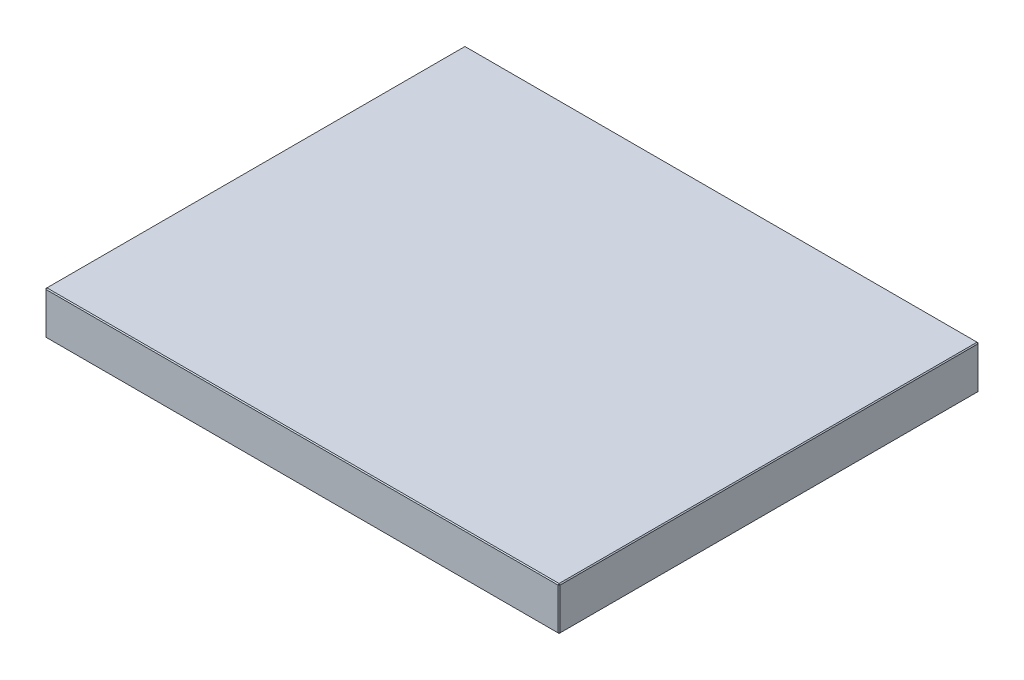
ISO-10303-21;
HEADER;
FILE_DESCRIPTION(('STEP AP214'),'2;1');
FILE_NAME('part.step','',(''),(''),'','','');
FILE_SCHEMA(('AUTOMOTIVE_DESIGN { 1 0 10303 214 1 1 1 1 }'));
ENDSEC;
DATA;
#1=APPLICATION_CONTEXT('core data for automotive mechanical design processes');
#2=APPLICATION_PROTOCOL_DEFINITION('international standard','automotive_design',2000,#1);
#3=PRODUCT_CONTEXT('',#1,'mechanical');
#4=PRODUCT('Part','Part','',(#3));
#5=PRODUCT_RELATED_PRODUCT_CATEGORY('part','',(#4));
#6=PRODUCT_DEFINITION_FORMATION('','',#4);
#7=PRODUCT_DEFINITION_CONTEXT('part definition',#1,'design');
#8=PRODUCT_DEFINITION('design','',#6,#7);
#9=PRODUCT_DEFINITION_SHAPE('','',#8);
#10=(LENGTH_UNIT() NAMED_UNIT(*) SI_UNIT(.MILLI.,.METRE.));
#11=(NAMED_UNIT(*) PLANE_ANGLE_UNIT() SI_UNIT($,.RADIAN.));
#12=(NAMED_UNIT(*) SI_UNIT($,.STERADIAN.) SOLID_ANGLE_UNIT());
#13=UNCERTAINTY_MEASURE_WITH_UNIT(LENGTH_MEASURE(1.E-05),#10,'distance_accuracy_value','');
#14=(GEOMETRIC_REPRESENTATION_CONTEXT(3) GLOBAL_UNCERTAINTY_ASSIGNED_CONTEXT((#13)) GLOBAL_UNIT_ASSIGNED_CONTEXT((#10,
#11,#12)) REPRESENTATION_CONTEXT('',''));
#15=CARTESIAN_POINT('',(0.,0.,0.));
#16=DIRECTION('',(0.,0.,1.));
#17=DIRECTION('',(1.,0.,0.));
#18=AXIS2_PLACEMENT_3D('',#15,#16,#17);
#19=CARTESIAN_POINT('',(-273.,46.,223.));
#20=DIRECTION('',(1.,0.,0.));
#21=DIRECTION('',(0.,0.,-1.));
#22=AXIS2_PLACEMENT_3D('',#19,#20,#21);
#23=PLANE('',#22);
#24=DIRECTION('',(0.,-1.,0.));
#25=VECTOR('',#24,1.);
#26=CARTESIAN_POINT('',(-273.,46.,-222.));
#27=LINE('',#26,#25);
#28=CARTESIAN_POINT('',(-273.,45.,-222.));
#29=VERTEX_POINT('',#28);
#30=CARTESIAN_POINT('',(-273.,1.,-222.));
#31=VERTEX_POINT('',#30);
#32=EDGE_CURVE('E115',#29,#31,#27,.T.);
#33=ORIENTED_EDGE('',*,*,#32,.T.);
#34=DIRECTION('',(0.,0.,1.));
#35=VECTOR('',#34,1.);
#36=CARTESIAN_POINT('',(-273.,1.,223.));
#37=LINE('',#36,#35);
#38=CARTESIAN_POINT('',(-273.,1.,222.));
#39=VERTEX_POINT('',#38);
#40=EDGE_CURVE('E111',#31,#39,#37,.T.);
#41=ORIENTED_EDGE('',*,*,#40,.T.);
#42=DIRECTION('',(0.,1.,0.));
#43=VECTOR('',#42,1.);
#44=CARTESIAN_POINT('',(-273.,46.,222.));
#45=LINE('',#44,#43);
#46=CARTESIAN_POINT('',(-273.,45.,222.));
#47=VERTEX_POINT('',#46);
#48=EDGE_CURVE('E104',#39,#47,#45,.T.);
#49=ORIENTED_EDGE('',*,*,#48,.T.);
#50=DIRECTION('',(0.,0.,-1.));
#51=VECTOR('',#50,1.);
#52=CARTESIAN_POINT('',(-273.,45.,-223.));
#53=LINE('',#52,#51);
#54=EDGE_CURVE('E108',#47,#29,#53,.T.);
#55=ORIENTED_EDGE('',*,*,#54,.T.);
#56=EDGE_LOOP('',(#33,#41,#49,#55));
#57=FACE_BOUND('',#56,.T.);
#58=ADVANCED_FACE('F16',(#57),#23,.F.);
#59=CARTESIAN_POINT('',(273.,46.,223.));
#60=DIRECTION('',(0.,0.,-1.));
#61=DIRECTION('',(-1.,0.,0.));
#62=AXIS2_PLACEMENT_3D('',#59,#60,#61);
#63=PLANE('',#62);
#64=DIRECTION('',(-1.,0.,0.));
#65=VECTOR('',#64,1.);
#66=CARTESIAN_POINT('',(-273.,45.,223.));
#67=LINE('',#66,#65);
#68=CARTESIAN_POINT('',(272.,45.,223.));
#69=VERTEX_POINT('',#68);
#70=CARTESIAN_POINT('',(-272.,45.,223.));
#71=VERTEX_POINT('',#70);
#72=EDGE_CURVE('E165',#69,#71,#67,.T.);
#73=ORIENTED_EDGE('',*,*,#72,.T.);
#74=DIRECTION('',(0.,-1.,0.));
#75=VECTOR('',#74,1.);
#76=CARTESIAN_POINT('',(-272.,46.,223.));
#77=LINE('',#76,#75);
#78=CARTESIAN_POINT('',(-272.,0.999999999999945,223.));
#79=VERTEX_POINT('',#78);
#80=EDGE_CURVE('E123',#71,#79,#77,.T.);
#81=ORIENTED_EDGE('',*,*,#80,.T.);
#82=DIRECTION('',(1.,0.,0.));
#83=VECTOR('',#82,1.);
#84=CARTESIAN_POINT('',(273.,0.999999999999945,223.));
#85=LINE('',#84,#83);
#86=CARTESIAN_POINT('',(272.,0.999999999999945,223.));
#87=VERTEX_POINT('',#86);
#88=EDGE_CURVE('E169',#79,#87,#85,.T.);
#89=ORIENTED_EDGE('',*,*,#88,.T.);
#90=DIRECTION('',(0.,1.,0.));
#91=VECTOR('',#90,1.);
#92=CARTESIAN_POINT('',(272.,46.,223.));
#93=LINE('',#92,#91);
#94=EDGE_CURVE('E167',#87,#69,#93,.T.);
#95=ORIENTED_EDGE('',*,*,#94,.T.);
#96=EDGE_LOOP('',(#73,#81,#89,#95));
#97=FACE_BOUND('',#96,.T.);
#98=ADVANCED_FACE('F276',(#97),#63,.F.);
#99=CARTESIAN_POINT('',(273.,46.,223.));
#100=DIRECTION('',(-1.,0.,0.));
#101=DIRECTION('',(0.,0.,1.));
#102=AXIS2_PLACEMENT_3D('',#99,#100,#101);
#103=PLANE('',#102);
#104=DIRECTION('',(0.,0.,-1.));
#105=VECTOR('',#104,1.);
#106=CARTESIAN_POINT('',(273.,0.999999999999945,223.));
#107=LINE('',#106,#105);
#108=CARTESIAN_POINT('',(273.,0.999999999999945,222.));
#109=VERTEX_POINT('',#108);
#110=CARTESIAN_POINT('',(273.,0.999999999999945,-222.));
#111=VERTEX_POINT('',#110);
#112=EDGE_CURVE('E160',#109,#111,#107,.T.);
#113=ORIENTED_EDGE('',*,*,#112,.T.);
#114=DIRECTION('',(0.,1.,0.));
#115=VECTOR('',#114,1.);
#116=CARTESIAN_POINT('',(273.,46.,-222.));
#117=LINE('',#116,#115);
#118=CARTESIAN_POINT('',(273.,45.,-222.));
#119=VERTEX_POINT('',#118);
#120=EDGE_CURVE('E162',#111,#119,#117,.T.);
#121=ORIENTED_EDGE('',*,*,#120,.T.);
#122=DIRECTION('',(0.,0.,1.));
#123=VECTOR('',#122,1.);
#124=CARTESIAN_POINT('',(273.,45.,223.));
#125=LINE('',#124,#123);
#126=CARTESIAN_POINT('',(273.,45.,222.));
#127=VERTEX_POINT('',#126);
#128=EDGE_CURVE('E156',#119,#127,#125,.T.);
#129=ORIENTED_EDGE('',*,*,#128,.T.);
#130=DIRECTION('',(0.,-1.,0.));
#131=VECTOR('',#130,1.);
#132=CARTESIAN_POINT('',(273.,46.,222.));
#133=LINE('',#132,#131);
#134=EDGE_CURVE('E158',#127,#109,#133,.T.);
#135=ORIENTED_EDGE('',*,*,#134,.T.);
#136=EDGE_LOOP('',(#113,#121,#129,#135));
#137=FACE_BOUND('',#136,.T.);
#138=ADVANCED_FACE('F255',(#137),#103,.F.);
#139=CARTESIAN_POINT('',(273.,46.,-223.));
#140=DIRECTION('',(0.,0.,1.));
#141=DIRECTION('',(1.,0.,0.));
#142=AXIS2_PLACEMENT_3D('',#139,#140,#141);
#143=PLANE('',#142);
#144=DIRECTION('',(0.,-1.,0.));
#145=VECTOR('',#144,1.);
#146=CARTESIAN_POINT('',(272.,46.,-223.));
#147=LINE('',#146,#145);
#148=CARTESIAN_POINT('',(272.,45.,-223.));
#149=VERTEX_POINT('',#148);
#150=CARTESIAN_POINT('',(272.,0.999999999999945,-223.));
#151=VERTEX_POINT('',#150);
#152=EDGE_CURVE('E149',#149,#151,#147,.T.);
#153=ORIENTED_EDGE('',*,*,#152,.T.);
#154=DIRECTION('',(-1.,0.,0.));
#155=VECTOR('',#154,1.);
#156=CARTESIAN_POINT('',(273.,0.999999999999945,-223.));
#157=LINE('',#156,#155);
#158=CARTESIAN_POINT('',(-272.,0.999999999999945,-223.));
#159=VERTEX_POINT('',#158);
#160=EDGE_CURVE('E154',#151,#159,#157,.T.);
#161=ORIENTED_EDGE('',*,*,#160,.T.);
#162=DIRECTION('',(0.,1.,0.));
#163=VECTOR('',#162,1.);
#164=CARTESIAN_POINT('',(-272.,46.,-223.));
#165=LINE('',#164,#163);
#166=CARTESIAN_POINT('',(-272.,45.,-223.));
#167=VERTEX_POINT('',#166);
#168=EDGE_CURVE('E151',#159,#167,#165,.T.);
#169=ORIENTED_EDGE('',*,*,#168,.T.);
#170=DIRECTION('',(1.,0.,0.));
#171=VECTOR('',#170,1.);
#172=CARTESIAN_POINT('',(273.,45.,-223.));
#173=LINE('',#172,#171);
#174=EDGE_CURVE('E147',#167,#149,#173,.T.);
#175=ORIENTED_EDGE('',*,*,#174,.T.);
#176=EDGE_LOOP('',(#153,#161,#169,#175));
#177=FACE_BOUND('',#176,.T.);
#178=ADVANCED_FACE('F285',(#177),#143,.F.);
#179=CARTESIAN_POINT('',(0.,46.,0.));
#180=DIRECTION('',(0.,1.,0.));
#181=DIRECTION('',(0.,0.,1.));
#182=AXIS2_PLACEMENT_3D('',#179,#180,#181);
#183=PLANE('',#182);
#184=DIRECTION('',(0.,0.,-1.));
#185=VECTOR('',#184,1.);
#186=CARTESIAN_POINT('',(272.,46.,-223.));
#187=LINE('',#186,#185);
#188=CARTESIAN_POINT('',(272.,46.,222.));
#189=VERTEX_POINT('',#188);
#190=CARTESIAN_POINT('',(272.,46.,-222.));
#191=VERTEX_POINT('',#190);
#192=EDGE_CURVE('E25',#189,#191,#187,.T.);
#193=ORIENTED_EDGE('',*,*,#192,.T.);
#194=DIRECTION('',(-1.,0.,0.));
#195=VECTOR('',#194,1.);
#196=CARTESIAN_POINT('',(-273.,46.,-222.));
#197=LINE('',#196,#195);
#198=CARTESIAN_POINT('',(-272.,46.,-222.));
#199=VERTEX_POINT('',#198);
#200=EDGE_CURVE('E10',#191,#199,#197,.T.);
#201=ORIENTED_EDGE('',*,*,#200,.T.);
#202=DIRECTION('',(0.,0.,1.));
#203=VECTOR('',#202,1.);
#204=CARTESIAN_POINT('',(-272.,46.,223.));
#205=LINE('',#204,#203);
#206=CARTESIAN_POINT('',(-272.,46.,222.));
#207=VERTEX_POINT('',#206);
#208=EDGE_CURVE('E181',#199,#207,#205,.T.);
#209=ORIENTED_EDGE('',*,*,#208,.T.);
#210=DIRECTION('',(1.,0.,0.));
#211=VECTOR('',#210,1.);
#212=CARTESIAN_POINT('',(273.,46.,222.));
#213=LINE('',#212,#211);
#214=EDGE_CURVE('E36',#207,#189,#213,.T.);
#215=ORIENTED_EDGE('',*,*,#214,.T.);
#216=EDGE_LOOP('',(#193,#201,#209,#215));
#217=FACE_BOUND('',#216,.T.);
#218=ADVANCED_FACE('F351',(#217),#183,.T.);
#219=CARTESIAN_POINT('',(0.,0.,0.));
#220=DIRECTION('',(0.,1.,0.));
#221=DIRECTION('',(0.,0.,1.));
#222=AXIS2_PLACEMENT_3D('',#219,#220,#221);
#223=PLANE('',#222);
#224=DIRECTION('',(0.,0.,1.));
#225=VECTOR('',#224,1.);
#226=CARTESIAN_POINT('',(272.,0.,0.));
#227=LINE('',#226,#225);
#228=CARTESIAN_POINT('',(272.,0.,-222.));
#229=VERTEX_POINT('',#228);
#230=CARTESIAN_POINT('',(272.,0.,222.));
#231=VERTEX_POINT('',#230);
#232=EDGE_CURVE('E172',#229,#231,#227,.T.);
#233=ORIENTED_EDGE('',*,*,#232,.T.);
#234=DIRECTION('',(-1.,0.,0.));
#235=VECTOR('',#234,1.);
#236=CARTESIAN_POINT('',(0.,0.,222.));
#237=LINE('',#236,#235);
#238=CARTESIAN_POINT('',(-272.,0.,222.));
#239=VERTEX_POINT('',#238);
#240=EDGE_CURVE('E178',#231,#239,#237,.T.);
#241=ORIENTED_EDGE('',*,*,#240,.T.);
#242=DIRECTION('',(0.,0.,-1.));
#243=VECTOR('',#242,1.);
#244=CARTESIAN_POINT('',(-272.,0.,0.));
#245=LINE('',#244,#243);
#246=CARTESIAN_POINT('',(-272.,0.,-222.));
#247=VERTEX_POINT('',#246);
#248=EDGE_CURVE('E176',#239,#247,#245,.T.);
#249=ORIENTED_EDGE('',*,*,#248,.T.);
#250=DIRECTION('',(1.,0.,0.));
#251=VECTOR('',#250,1.);
#252=CARTESIAN_POINT('',(0.,0.,-222.));
#253=LINE('',#252,#251);
#254=EDGE_CURVE('E174',#247,#229,#253,.T.);
#255=ORIENTED_EDGE('',*,*,#254,.T.);
#256=EDGE_LOOP('',(#233,#241,#249,#255));
#257=FACE_BOUND('',#256,.T.);
#258=ADVANCED_FACE('F247',(#257),#223,.F.);
#259=CARTESIAN_POINT('',(273.,46.,222.));
#260=DIRECTION('',(-0.707106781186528,0.,-0.707106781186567));
#261=DIRECTION('',(0.,-1.,0.));
#262=AXIS2_PLACEMENT_3D('',#259,#260,#261);
#263=PLANE('',#262);
#264=DIRECTION('',(-0.707106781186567,0.,0.707106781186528));
#265=VECTOR('',#264,1.);
#266=CARTESIAN_POINT('',(272.,45.,223.));
#267=LINE('',#266,#265);
#268=EDGE_CURVE('E20',#69,#127,#267,.F.);
#269=ORIENTED_EDGE('',*,*,#268,.F.);
#270=ORIENTED_EDGE('',*,*,#94,.F.);
#271=DIRECTION('',(0.707106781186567,0.,-0.707106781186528));
#272=VECTOR('',#271,1.);
#273=CARTESIAN_POINT('',(272.,0.999999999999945,223.));
#274=LINE('',#273,#272);
#275=EDGE_CURVE('E143',#109,#87,#274,.F.);
#276=ORIENTED_EDGE('',*,*,#275,.F.);
#277=ORIENTED_EDGE('',*,*,#134,.F.);
#278=EDGE_LOOP('',(#269,#270,#276,#277));
#279=FACE_BOUND('',#278,.T.);
#280=ADVANCED_FACE('F18',(#279),#263,.F.);
#281=CARTESIAN_POINT('',(272.,45.,223.));
#282=DIRECTION('',(0.577350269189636,0.577350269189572,0.577350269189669));
#283=DIRECTION('',(0.707106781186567,0.,-0.707106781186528));
#284=AXIS2_PLACEMENT_3D('',#281,#282,#283);
#285=PLANE('',#284);
#286=DIRECTION('',(0.,-0.707106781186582,0.707106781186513));
#287=VECTOR('',#286,1.);
#288=CARTESIAN_POINT('',(272.,45.,223.));
#289=LINE('',#288,#287);
#290=EDGE_CURVE('E227',#69,#189,#289,.F.);
#291=ORIENTED_EDGE('',*,*,#290,.F.);
#292=ORIENTED_EDGE('',*,*,#268,.T.);
#293=DIRECTION('',(-0.707106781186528,0.707106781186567,0.));
#294=VECTOR('',#293,1.);
#295=CARTESIAN_POINT('',(272.5,45.5,222.));
#296=LINE('',#295,#294);
#297=EDGE_CURVE('E229',#189,#127,#296,.F.);
#298=ORIENTED_EDGE('',*,*,#297,.F.);
#299=EDGE_LOOP('',(#291,#292,#298));
#300=FACE_BOUND('',#299,.T.);
#301=ADVANCED_FACE('F271',(#300),#285,.T.);
#302=CARTESIAN_POINT('',(272.,0.999999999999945,223.));
#303=DIRECTION('',(0.577350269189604,-0.577350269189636,0.577350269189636));
#304=DIRECTION('',(0.,-0.707106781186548,-0.707106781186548));
#305=AXIS2_PLACEMENT_3D('',#302,#303,#304);
#306=PLANE('',#305);
#307=DIRECTION('',(-0.707106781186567,-0.707106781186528,0.));
#308=VECTOR('',#307,1.);
#309=CARTESIAN_POINT('',(272.5,0.499999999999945,222.));
#310=LINE('',#309,#308);
#311=EDGE_CURVE('E221',#109,#231,#310,.T.);
#312=ORIENTED_EDGE('',*,*,#311,.F.);
#313=ORIENTED_EDGE('',*,*,#275,.T.);
#314=DIRECTION('',(0.,0.707106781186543,0.707106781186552));
#315=VECTOR('',#314,1.);
#316=CARTESIAN_POINT('',(272.,0.999999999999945,223.));
#317=LINE('',#316,#315);
#318=EDGE_CURVE('E224',#231,#87,#317,.T.);
#319=ORIENTED_EDGE('',*,*,#318,.F.);
#320=EDGE_LOOP('',(#312,#313,#319));
#321=FACE_BOUND('',#320,.T.);
#322=ADVANCED_FACE('F236',(#321),#306,.T.);
#323=CARTESIAN_POINT('',(272.,46.,0.));
#324=DIRECTION('',(0.707106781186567,0.707106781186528,0.));
#325=DIRECTION('',(0.,0.,1.));
#326=AXIS2_PLACEMENT_3D('',#323,#324,#325);
#327=PLANE('',#326);
#328=ORIENTED_EDGE('',*,*,#297,.T.);
#329=ORIENTED_EDGE('',*,*,#128,.F.);
#330=DIRECTION('',(0.707106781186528,-0.707106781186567,0.));
#331=VECTOR('',#330,1.);
#332=CARTESIAN_POINT('',(273.,45.,-222.));
#333=LINE('',#332,#331);
#334=EDGE_CURVE('E216',#191,#119,#333,.T.);
#335=ORIENTED_EDGE('',*,*,#334,.F.);
#336=ORIENTED_EDGE('',*,*,#192,.F.);
#337=EDGE_LOOP('',(#328,#329,#335,#336));
#338=FACE_BOUND('',#337,.T.);
#339=ADVANCED_FACE('F266',(#338),#327,.T.);
#340=CARTESIAN_POINT('',(0.,46.,222.));
#341=DIRECTION('',(0.,0.707106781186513,0.707106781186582));
#342=DIRECTION('',(-1.,0.,0.));
#343=AXIS2_PLACEMENT_3D('',#340,#341,#342);
#344=PLANE('',#343);
#345=ORIENTED_EDGE('',*,*,#290,.T.);
#346=ORIENTED_EDGE('',*,*,#214,.F.);
#347=DIRECTION('',(0.,0.707106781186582,-0.707106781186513));
#348=VECTOR('',#347,1.);
#349=CARTESIAN_POINT('',(-272.,45.5,222.5));
#350=LINE('',#349,#348);
#351=EDGE_CURVE('E127',#71,#207,#350,.T.);
#352=ORIENTED_EDGE('',*,*,#351,.F.);
#353=ORIENTED_EDGE('',*,*,#72,.F.);
#354=EDGE_LOOP('',(#345,#346,#352,#353));
#355=FACE_BOUND('',#354,.T.);
#356=ADVANCED_FACE('F274',(#355),#344,.T.);
#357=CARTESIAN_POINT('',(-272.,46.,223.));
#358=DIRECTION('',(0.707106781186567,0.,-0.707106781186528));
#359=DIRECTION('',(0.,-1.,0.));
#360=AXIS2_PLACEMENT_3D('',#357,#358,#359);
#361=PLANE('',#360);
#362=DIRECTION('',(0.707106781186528,0.,0.707106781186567));
#363=VECTOR('',#362,1.);
#364=CARTESIAN_POINT('',(-272.,0.999999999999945,223.));
#365=LINE('',#364,#363);
#366=EDGE_CURVE('E128',#79,#39,#365,.F.);
#367=ORIENTED_EDGE('',*,*,#366,.F.);
#368=ORIENTED_EDGE('',*,*,#80,.F.);
#369=DIRECTION('',(-0.707106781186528,0.,-0.707106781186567));
#370=VECTOR('',#369,1.);
#371=CARTESIAN_POINT('',(-273.,45.,222.));
#372=LINE('',#371,#370);
#373=EDGE_CURVE('E119',#47,#71,#372,.F.);
#374=ORIENTED_EDGE('',*,*,#373,.F.);
#375=ORIENTED_EDGE('',*,*,#48,.F.);
#376=EDGE_LOOP('',(#367,#368,#374,#375));
#377=FACE_BOUND('',#376,.T.);
#378=ADVANCED_FACE('F121',(#377),#361,.F.);
#379=CARTESIAN_POINT('',(273.,0.999999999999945,223.));
#380=DIRECTION('',(0.,0.707106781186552,-0.707106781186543));
#381=DIRECTION('',(1.,0.,0.));
#382=AXIS2_PLACEMENT_3D('',#379,#380,#381);
#383=PLANE('',#382);
#384=ORIENTED_EDGE('',*,*,#318,.T.);
#385=ORIENTED_EDGE('',*,*,#88,.F.);
#386=DIRECTION('',(0.,-0.707106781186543,-0.707106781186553));
#387=VECTOR('',#386,1.);
#388=CARTESIAN_POINT('',(-272.,0.999999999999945,223.));
#389=LINE('',#388,#387);
#390=EDGE_CURVE('E212',#239,#79,#389,.F.);
#391=ORIENTED_EDGE('',*,*,#390,.F.);
#392=ORIENTED_EDGE('',*,*,#240,.F.);
#393=EDGE_LOOP('',(#384,#385,#391,#392));
#394=FACE_BOUND('',#393,.T.);
#395=ADVANCED_FACE('F244',(#394),#383,.F.);
#396=CARTESIAN_POINT('',(273.,0.999999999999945,223.));
#397=DIRECTION('',(-0.707106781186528,0.707106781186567,0.));
#398=DIRECTION('',(0.,0.,-1.));
#399=AXIS2_PLACEMENT_3D('',#396,#397,#398);
#400=PLANE('',#399);
#401=ORIENTED_EDGE('',*,*,#311,.T.);
#402=ORIENTED_EDGE('',*,*,#232,.F.);
#403=DIRECTION('',(0.707106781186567,0.707106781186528,0.));
#404=VECTOR('',#403,1.);
#405=CARTESIAN_POINT('',(272.5,0.499999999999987,-222.));
#406=LINE('',#405,#404);
#407=EDGE_CURVE('E209',#111,#229,#406,.F.);
#408=ORIENTED_EDGE('',*,*,#407,.F.);
#409=ORIENTED_EDGE('',*,*,#112,.F.);
#410=EDGE_LOOP('',(#401,#402,#408,#409));
#411=FACE_BOUND('',#410,.T.);
#412=ADVANCED_FACE('F252',(#411),#400,.F.);
#413=CARTESIAN_POINT('',(272.,46.,-223.));
#414=DIRECTION('',(-0.707106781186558,0.,0.707106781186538));
#415=DIRECTION('',(0.,-1.,0.));
#416=AXIS2_PLACEMENT_3D('',#413,#414,#415);
#417=PLANE('',#416);
#418=DIRECTION('',(0.707106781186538,0.,0.707106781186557));
#419=VECTOR('',#418,1.);
#420=CARTESIAN_POINT('',(273.,45.,-222.));
#421=LINE('',#420,#419);
#422=EDGE_CURVE('E218',#119,#149,#421,.F.);
#423=ORIENTED_EDGE('',*,*,#422,.F.);
#424=ORIENTED_EDGE('',*,*,#120,.F.);
#425=DIRECTION('',(-0.707106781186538,0.,-0.707106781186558));
#426=VECTOR('',#425,1.);
#427=CARTESIAN_POINT('',(272.,0.999999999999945,-223.));
#428=LINE('',#427,#426);
#429=EDGE_CURVE('E206',#151,#111,#428,.F.);
#430=ORIENTED_EDGE('',*,*,#429,.F.);
#431=ORIENTED_EDGE('',*,*,#152,.F.);
#432=EDGE_LOOP('',(#423,#424,#430,#431));
#433=FACE_BOUND('',#432,.T.);
#434=ADVANCED_FACE('F259',(#433),#417,.F.);
#435=CARTESIAN_POINT('',(273.,45.,-222.));
#436=DIRECTION('',(0.577350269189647,0.577350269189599,-0.577350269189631));
#437=DIRECTION('',(-0.707106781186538,0.,-0.707106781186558));
#438=AXIS2_PLACEMENT_3D('',#435,#436,#437);
#439=PLANE('',#438);
#440=ORIENTED_EDGE('',*,*,#334,.T.);
#441=ORIENTED_EDGE('',*,*,#422,.T.);
#442=DIRECTION('',(0.,0.707106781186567,0.707106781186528));
#443=VECTOR('',#442,1.);
#444=CARTESIAN_POINT('',(272.,45.5,-222.5));
#445=LINE('',#444,#443);
#446=EDGE_CURVE('E135',#191,#149,#445,.F.);
#447=ORIENTED_EDGE('',*,*,#446,.F.);
#448=EDGE_LOOP('',(#440,#441,#447));
#449=FACE_BOUND('',#448,.T.);
#450=ADVANCED_FACE('F326',(#449),#439,.T.);
#451=CARTESIAN_POINT('',(-273.,45.,222.));
#452=DIRECTION('',(-0.577350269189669,0.577350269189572,0.577350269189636));
#453=DIRECTION('',(0.707106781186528,0.,0.707106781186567));
#454=AXIS2_PLACEMENT_3D('',#451,#452,#453);
#455=PLANE('',#454);
#456=ORIENTED_EDGE('',*,*,#373,.T.);
#457=ORIENTED_EDGE('',*,*,#351,.T.);
#458=DIRECTION('',(-0.707106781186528,-0.707106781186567,0.));
#459=VECTOR('',#458,1.);
#460=CARTESIAN_POINT('',(-273.,45.,222.));
#461=LINE('',#460,#459);
#462=EDGE_CURVE('E131',#47,#207,#461,.F.);
#463=ORIENTED_EDGE('',*,*,#462,.F.);
#464=EDGE_LOOP('',(#456,#457,#463));
#465=FACE_BOUND('',#464,.T.);
#466=ADVANCED_FACE('F132',(#465),#455,.T.);
#467=CARTESIAN_POINT('',(-272.,0.999999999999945,223.));
#468=DIRECTION('',(-0.577350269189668,-0.577350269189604,0.577350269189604));
#469=DIRECTION('',(0.707106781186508,0.,0.707106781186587));
#470=AXIS2_PLACEMENT_3D('',#467,#468,#469);
#471=PLANE('',#470);
#472=ORIENTED_EDGE('',*,*,#390,.T.);
#473=ORIENTED_EDGE('',*,*,#366,.T.);
#474=DIRECTION('',(-0.707106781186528,0.707106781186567,0.));
#475=VECTOR('',#474,1.);
#476=CARTESIAN_POINT('',(-272.5,0.499999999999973,222.));
#477=LINE('',#476,#475);
#478=EDGE_CURVE('E136',#239,#39,#477,.T.);
#479=ORIENTED_EDGE('',*,*,#478,.F.);
#480=EDGE_LOOP('',(#472,#473,#479));
#481=FACE_BOUND('',#480,.T.);
#482=ADVANCED_FACE('F319',(#481),#471,.T.);
#483=CARTESIAN_POINT('',(272.,0.999999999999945,-223.));
#484=DIRECTION('',(0.577350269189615,-0.577350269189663,-0.577350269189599));
#485=DIRECTION('',(0.707106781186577,0.707106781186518,0.));
#486=AXIS2_PLACEMENT_3D('',#483,#484,#485);
#487=PLANE('',#486);
#488=ORIENTED_EDGE('',*,*,#429,.T.);
#489=ORIENTED_EDGE('',*,*,#407,.T.);
#490=DIRECTION('',(0.,-0.707106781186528,0.707106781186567));
#491=VECTOR('',#490,1.);
#492=CARTESIAN_POINT('',(272.,0.999999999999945,-223.));
#493=LINE('',#492,#491);
#494=EDGE_CURVE('E199',#151,#229,#493,.T.);
#495=ORIENTED_EDGE('',*,*,#494,.F.);
#496=EDGE_LOOP('',(#488,#489,#495));
#497=FACE_BOUND('',#496,.T.);
#498=ADVANCED_FACE('F315',(#497),#487,.T.);
#499=CARTESIAN_POINT('',(0.,46.,-222.));
#500=DIRECTION('',(0.,0.707106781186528,-0.707106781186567));
#501=DIRECTION('',(1.,0.,0.));
#502=AXIS2_PLACEMENT_3D('',#499,#500,#501);
#503=PLANE('',#502);
#504=ORIENTED_EDGE('',*,*,#446,.T.);
#505=ORIENTED_EDGE('',*,*,#174,.F.);
#506=DIRECTION('',(0.,-0.707106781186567,-0.707106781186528));
#507=VECTOR('',#506,1.);
#508=CARTESIAN_POINT('',(-272.,45.,-223.));
#509=LINE('',#508,#507);
#510=EDGE_CURVE('E196',#199,#167,#509,.T.);
#511=ORIENTED_EDGE('',*,*,#510,.F.);
#512=ORIENTED_EDGE('',*,*,#200,.F.);
#513=EDGE_LOOP('',(#504,#505,#511,#512));
#514=FACE_BOUND('',#513,.T.);
#515=ADVANCED_FACE('F312',(#514),#503,.T.);
#516=CARTESIAN_POINT('',(-272.,46.,0.));
#517=DIRECTION('',(-0.707106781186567,0.707106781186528,0.));
#518=DIRECTION('',(0.,0.,-1.));
#519=AXIS2_PLACEMENT_3D('',#516,#517,#518);
#520=PLANE('',#519);
#521=ORIENTED_EDGE('',*,*,#462,.T.);
#522=ORIENTED_EDGE('',*,*,#208,.F.);
#523=DIRECTION('',(0.707106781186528,0.707106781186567,0.));
#524=VECTOR('',#523,1.);
#525=CARTESIAN_POINT('',(-272.5,45.5,-222.));
#526=LINE('',#525,#524);
#527=EDGE_CURVE('E139',#29,#199,#526,.T.);
#528=ORIENTED_EDGE('',*,*,#527,.F.);
#529=ORIENTED_EDGE('',*,*,#54,.F.);
#530=EDGE_LOOP('',(#521,#522,#528,#529));
#531=FACE_BOUND('',#530,.T.);
#532=ADVANCED_FACE('F138',(#531),#520,.T.);
#533=CARTESIAN_POINT('',(-273.,1.,223.));
#534=DIRECTION('',(0.707106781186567,0.707106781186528,0.));
#535=DIRECTION('',(0.,0.,1.));
#536=AXIS2_PLACEMENT_3D('',#533,#534,#535);
#537=PLANE('',#536);
#538=ORIENTED_EDGE('',*,*,#478,.T.);
#539=ORIENTED_EDGE('',*,*,#40,.F.);
#540=DIRECTION('',(0.707106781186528,-0.707106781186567,0.));
#541=VECTOR('',#540,1.);
#542=CARTESIAN_POINT('',(-273.,1.,-222.));
#543=LINE('',#542,#541);
#544=EDGE_CURVE('E192',#247,#31,#543,.F.);
#545=ORIENTED_EDGE('',*,*,#544,.F.);
#546=ORIENTED_EDGE('',*,*,#248,.F.);
#547=EDGE_LOOP('',(#538,#539,#545,#546));
#548=FACE_BOUND('',#547,.T.);
#549=ADVANCED_FACE('F305',(#548),#537,.F.);
#550=CARTESIAN_POINT('',(273.,0.999999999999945,-223.));
#551=DIRECTION('',(0.,0.707106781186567,0.707106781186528));
#552=DIRECTION('',(-1.,0.,0.));
#553=AXIS2_PLACEMENT_3D('',#550,#551,#552);
#554=PLANE('',#553);
#555=ORIENTED_EDGE('',*,*,#494,.T.);
#556=ORIENTED_EDGE('',*,*,#254,.F.);
#557=DIRECTION('',(0.,0.707106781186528,-0.707106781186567));
#558=VECTOR('',#557,1.);
#559=CARTESIAN_POINT('',(-272.,0.499999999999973,-222.5));
#560=LINE('',#559,#558);
#561=EDGE_CURVE('E189',#159,#247,#560,.F.);
#562=ORIENTED_EDGE('',*,*,#561,.F.);
#563=ORIENTED_EDGE('',*,*,#160,.F.);
#564=EDGE_LOOP('',(#555,#556,#562,#563));
#565=FACE_BOUND('',#564,.T.);
#566=ADVANCED_FACE('F301',(#565),#554,.F.);
#567=CARTESIAN_POINT('',(-272.,45.,-223.));
#568=DIRECTION('',(-0.577350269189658,0.577350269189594,-0.577350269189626));
#569=DIRECTION('',(-0.707106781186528,0.,0.707106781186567));
#570=AXIS2_PLACEMENT_3D('',#567,#568,#569);
#571=PLANE('',#570);
#572=ORIENTED_EDGE('',*,*,#527,.T.);
#573=ORIENTED_EDGE('',*,*,#510,.T.);
#574=DIRECTION('',(0.707106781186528,0.,-0.707106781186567));
#575=VECTOR('',#574,1.);
#576=CARTESIAN_POINT('',(-272.,45.,-223.));
#577=LINE('',#576,#575);
#578=EDGE_CURVE('E187',#29,#167,#577,.T.);
#579=ORIENTED_EDGE('',*,*,#578,.F.);
#580=EDGE_LOOP('',(#572,#573,#579));
#581=FACE_BOUND('',#580,.T.);
#582=ADVANCED_FACE('F297',(#581),#571,.T.);
#583=CARTESIAN_POINT('',(-273.,1.,-222.));
#584=DIRECTION('',(-0.577350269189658,-0.577350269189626,-0.577350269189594));
#585=DIRECTION('',(0.707106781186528,-0.707106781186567,0.));
#586=AXIS2_PLACEMENT_3D('',#583,#584,#585);
#587=PLANE('',#586);
#588=ORIENTED_EDGE('',*,*,#561,.T.);
#589=ORIENTED_EDGE('',*,*,#544,.T.);
#590=DIRECTION('',(-0.707106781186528,0.,0.707106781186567));
#591=VECTOR('',#590,1.);
#592=CARTESIAN_POINT('',(-273.,1.,-222.));
#593=LINE('',#592,#591);
#594=EDGE_CURVE('E185',#159,#31,#593,.T.);
#595=ORIENTED_EDGE('',*,*,#594,.F.);
#596=EDGE_LOOP('',(#588,#589,#595));
#597=FACE_BOUND('',#596,.T.);
#598=ADVANCED_FACE('F293',(#597),#587,.T.);
#599=CARTESIAN_POINT('',(-273.,46.,-222.));
#600=DIRECTION('',(0.707106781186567,0.,0.707106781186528));
#601=DIRECTION('',(0.,-1.,0.));
#602=AXIS2_PLACEMENT_3D('',#599,#600,#601);
#603=PLANE('',#602);
#604=ORIENTED_EDGE('',*,*,#578,.T.);
#605=ORIENTED_EDGE('',*,*,#168,.F.);
#606=ORIENTED_EDGE('',*,*,#594,.T.);
#607=ORIENTED_EDGE('',*,*,#32,.F.);
#608=EDGE_LOOP('',(#604,#605,#606,#607));
#609=FACE_BOUND('',#608,.T.);
#610=ADVANCED_FACE('F290',(#609),#603,.F.);
#611=CLOSED_SHELL('',(#58,#98,#138,#178,#218,#258,#280,#301,#322,#339,#356,#378,#395,#412,#434,
#450,#466,#482,#498,#515,#532,#549,#566,#582,#598,#610));
#612=MANIFOLD_SOLID_BREP('B1',#611);
#613=ADVANCED_BREP_SHAPE_REPRESENTATION('',(#18,#612),#14);
#614=SHAPE_DEFINITION_REPRESENTATION(#9,#613);
ENDSEC;
END-ISO-10303-21;
